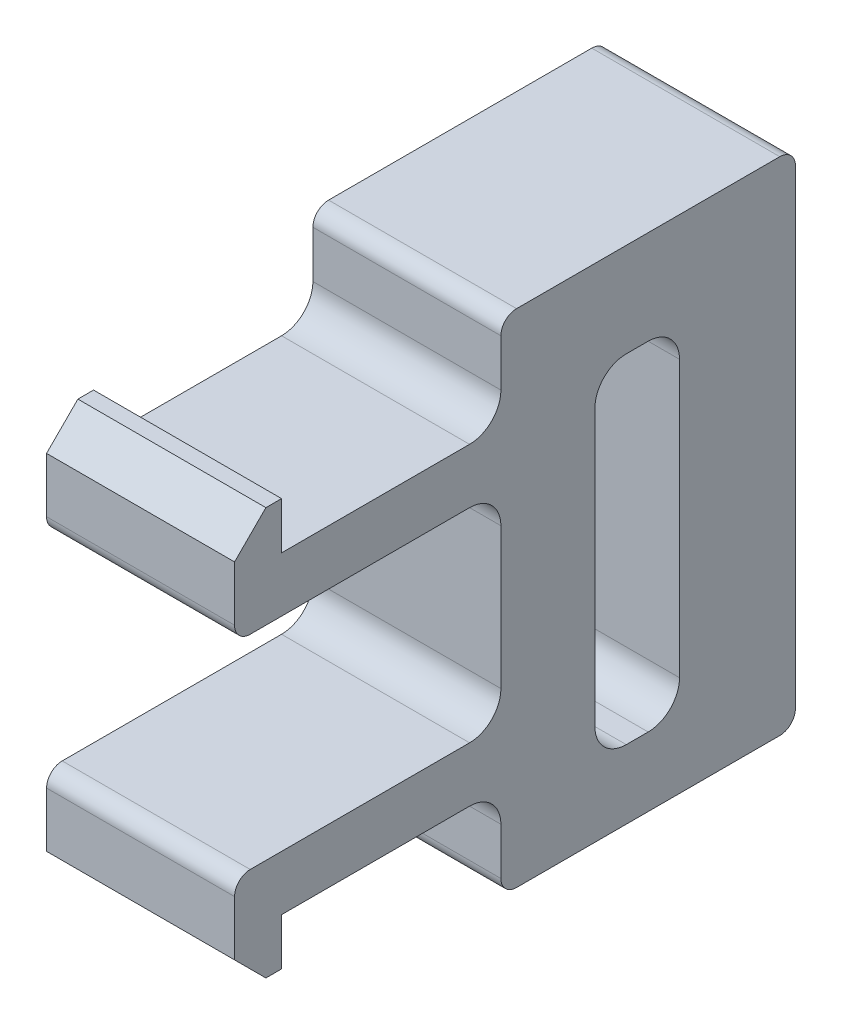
ISO-10303-21;
HEADER;
FILE_DESCRIPTION(('STEP AP214'),'2;1');
FILE_NAME('part.step','',(''),(''),'','','');
FILE_SCHEMA(('AUTOMOTIVE_DESIGN { 1 0 10303 214 1 1 1 1 }'));
ENDSEC;
DATA;
#1=APPLICATION_CONTEXT('core data for automotive mechanical design processes');
#2=APPLICATION_PROTOCOL_DEFINITION('international standard','automotive_design',2000,#1);
#3=PRODUCT_CONTEXT('',#1,'mechanical');
#4=PRODUCT('Part','Part','',(#3));
#5=PRODUCT_RELATED_PRODUCT_CATEGORY('part','',(#4));
#6=PRODUCT_DEFINITION_FORMATION('','',#4);
#7=PRODUCT_DEFINITION_CONTEXT('part definition',#1,'design');
#8=PRODUCT_DEFINITION('design','',#6,#7);
#9=PRODUCT_DEFINITION_SHAPE('','',#8);
#10=(LENGTH_UNIT() NAMED_UNIT(*) SI_UNIT(.MILLI.,.METRE.));
#11=(NAMED_UNIT(*) PLANE_ANGLE_UNIT() SI_UNIT($,.RADIAN.));
#12=(NAMED_UNIT(*) SI_UNIT($,.STERADIAN.) SOLID_ANGLE_UNIT());
#13=UNCERTAINTY_MEASURE_WITH_UNIT(LENGTH_MEASURE(1.E-05),#10,'distance_accuracy_value','');
#14=(GEOMETRIC_REPRESENTATION_CONTEXT(3) GLOBAL_UNCERTAINTY_ASSIGNED_CONTEXT((#13)) GLOBAL_UNIT_ASSIGNED_CONTEXT((#10,
#11,#12)) REPRESENTATION_CONTEXT('',''));
#15=CARTESIAN_POINT('',(0.,0.,0.));
#16=DIRECTION('',(0.,0.,1.));
#17=DIRECTION('',(1.,0.,0.));
#18=AXIS2_PLACEMENT_3D('',#15,#16,#17);
#19=CARTESIAN_POINT('',(52.8,29.5897807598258,9.4));
#20=DIRECTION('',(0.,0.,1.));
#21=DIRECTION('',(1.,0.,0.));
#22=AXIS2_PLACEMENT_3D('',#19,#20,#21);
#23=PLANE('',#22);
#24=DIRECTION('',(0.,-1.,0.));
#25=VECTOR('',#24,1.);
#26=CARTESIAN_POINT('',(52.8,45.5897807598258,9.4));
#27=LINE('',#26,#25);
#28=CARTESIAN_POINT('',(52.8,39.8397807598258,9.4));
#29=VERTEX_POINT('',#28);
#30=CARTESIAN_POINT('',(52.8,35.3397807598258,9.4));
#31=VERTEX_POINT('',#30);
#32=EDGE_CURVE('E461',#29,#31,#27,.T.);
#33=ORIENTED_EDGE('',*,*,#32,.T.);
#34=DIRECTION('',(-1.,0.,0.));
#35=VECTOR('',#34,1.);
#36=CARTESIAN_POINT('',(58.8,35.3397807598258,9.4));
#37=LINE('',#36,#35);
#38=CARTESIAN_POINT('',(58.8,35.3397807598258,9.4));
#39=VERTEX_POINT('',#38);
#40=EDGE_CURVE('E504',#31,#39,#37,.F.);
#41=ORIENTED_EDGE('',*,*,#40,.T.);
#42=DIRECTION('',(0.,1.,0.));
#43=VECTOR('',#42,1.);
#44=CARTESIAN_POINT('',(58.8,45.5897807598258,9.4));
#45=LINE('',#44,#43);
#46=CARTESIAN_POINT('',(58.8,39.8397807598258,9.4));
#47=VERTEX_POINT('',#46);
#48=EDGE_CURVE('E458',#39,#47,#45,.T.);
#49=ORIENTED_EDGE('',*,*,#48,.T.);
#50=DIRECTION('',(1.,0.,0.));
#51=VECTOR('',#50,1.);
#52=CARTESIAN_POINT('',(52.8,39.8397807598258,9.4));
#53=LINE('',#52,#51);
#54=EDGE_CURVE('E502',#47,#29,#53,.F.);
#55=ORIENTED_EDGE('',*,*,#54,.T.);
#56=EDGE_LOOP('',(#33,#41,#49,#55));
#57=FACE_BOUND('',#56,.T.);
#58=ADVANCED_FACE('F67',(#57),#23,.T.);
#59=CARTESIAN_POINT('',(52.8,31.5897807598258,9.4));
#60=VERTEX_POINT('',#59);
#61=CARTESIAN_POINT('',(52.8,30.0897807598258,9.4));
#62=VERTEX_POINT('',#61);
#63=EDGE_CURVE('E457',#60,#62,#27,.T.);
#64=ORIENTED_EDGE('',*,*,#63,.T.);
#65=DIRECTION('',(1.,0.,0.));
#66=VECTOR('',#65,1.);
#67=CARTESIAN_POINT('',(58.8,30.0897807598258,9.4));
#68=LINE('',#67,#66);
#69=CARTESIAN_POINT('',(58.8,30.0897807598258,9.4));
#70=VERTEX_POINT('',#69);
#71=EDGE_CURVE('E601',#62,#70,#68,.T.);
#72=ORIENTED_EDGE('',*,*,#71,.T.);
#73=CARTESIAN_POINT('',(58.8,31.5897807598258,9.4));
#74=VERTEX_POINT('',#73);
#75=EDGE_CURVE('E455',#70,#74,#45,.T.);
#76=ORIENTED_EDGE('',*,*,#75,.T.);
#77=DIRECTION('',(1.,0.,0.));
#78=VECTOR('',#77,1.);
#79=CARTESIAN_POINT('',(52.8,31.5897807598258,9.4));
#80=LINE('',#79,#78);
#81=EDGE_CURVE('E514',#74,#60,#80,.F.);
#82=ORIENTED_EDGE('',*,*,#81,.T.);
#83=EDGE_LOOP('',(#64,#72,#76,#82));
#84=FACE_BOUND('',#83,.T.);
#85=ADVANCED_FACE('F619',(#84),#23,.T.);
#86=CARTESIAN_POINT('',(58.8,45.5897807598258,3.7));
#87=DIRECTION('',(0.,0.,-1.));
#88=DIRECTION('',(-1.,0.,0.));
#89=AXIS2_PLACEMENT_3D('',#86,#87,#88);
#90=PLANE('',#89);
#91=DIRECTION('',(1.,0.,0.));
#92=VECTOR('',#91,1.);
#93=CARTESIAN_POINT('',(52.8,41.5897807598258,3.7));
#94=LINE('',#93,#92);
#95=CARTESIAN_POINT('',(58.8,41.5897807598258,3.7));
#96=VERTEX_POINT('',#95);
#97=CARTESIAN_POINT('',(53.5846096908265,41.5897807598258,3.7));
#98=VERTEX_POINT('',#97);
#99=EDGE_CURVE('E491',#96,#98,#94,.F.);
#100=ORIENTED_EDGE('',*,*,#99,.T.);
#101=DIRECTION('',(0.258819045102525,-0.965925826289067,0.));
#102=VECTOR('',#101,1.);
#103=CARTESIAN_POINT('',(52.9339745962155,44.0179839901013,3.7));
#104=LINE('',#103,#102);
#105=CARTESIAN_POINT('',(53.8525588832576,40.5897807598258,3.7));
#106=VERTEX_POINT('',#105);
#107=EDGE_CURVE('E82',#98,#106,#104,.T.);
#108=ORIENTED_EDGE('',*,*,#107,.T.);
#109=DIRECTION('',(-1.,0.,0.));
#110=VECTOR('',#109,1.);
#111=CARTESIAN_POINT('',(52.8,40.5897807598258,3.7));
#112=LINE('',#111,#110);
#113=CARTESIAN_POINT('',(54.8,40.5897807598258,3.7));
#114=VERTEX_POINT('',#113);
#115=EDGE_CURVE('E465',#114,#106,#112,.T.);
#116=ORIENTED_EDGE('',*,*,#115,.F.);
#117=CARTESIAN_POINT('',(54.8,39.5897807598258,3.7));
#118=DIRECTION('',(0.,0.,-1.));
#119=DIRECTION('',(-1.,0.,0.));
#120=AXIS2_PLACEMENT_3D('',#117,#118,#119);
#121=CIRCLE('',#120,1.);
#122=CARTESIAN_POINT('',(55.8,39.5897807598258,3.7));
#123=VERTEX_POINT('',#122);
#124=EDGE_CURVE('E550',#114,#123,#121,.T.);
#125=ORIENTED_EDGE('',*,*,#124,.T.);
#126=DIRECTION('',(0.,1.,0.));
#127=VECTOR('',#126,1.);
#128=CARTESIAN_POINT('',(55.8,29.5897807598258,3.7));
#129=LINE('',#128,#127);
#130=CARTESIAN_POINT('',(55.8,33.3218315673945,3.7));
#131=VERTEX_POINT('',#130);
#132=EDGE_CURVE('E463',#131,#123,#129,.T.);
#133=ORIENTED_EDGE('',*,*,#132,.F.);
#134=CARTESIAN_POINT('',(55.9425625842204,32.7897807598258,3.7));
#135=VERTEX_POINT('',#134);
#136=EDGE_CURVE('E371',#131,#135,#104,.T.);
#137=ORIENTED_EDGE('',*,*,#136,.T.);
#138=DIRECTION('',(-1.,0.,0.));
#139=VECTOR('',#138,1.);
#140=CARTESIAN_POINT('',(58.8,32.7897807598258,3.7));
#141=LINE('',#140,#139);
#142=CARTESIAN_POINT('',(58.8,32.7897807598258,3.7));
#143=VERTEX_POINT('',#142);
#144=EDGE_CURVE('E489',#135,#143,#141,.F.);
#145=ORIENTED_EDGE('',*,*,#144,.T.);
#146=DIRECTION('',(0.,1.,0.));
#147=VECTOR('',#146,1.);
#148=CARTESIAN_POINT('',(58.8,29.5897807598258,3.7));
#149=LINE('',#148,#147);
#150=EDGE_CURVE('E478',#143,#96,#149,.T.);
#151=ORIENTED_EDGE('',*,*,#150,.T.);
#152=EDGE_LOOP('',(#100,#108,#116,#125,#133,#137,#145,#151));
#153=FACE_BOUND('',#152,.T.);
#154=ADVANCED_FACE('F724',(#153),#90,.F.);
#155=CARTESIAN_POINT('',(58.8,45.5897807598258,3.7));
#156=DIRECTION('',(0.,-1.,0.));
#157=DIRECTION('',(0.,0.,-1.));
#158=AXIS2_PLACEMENT_3D('',#155,#156,#157);
#159=PLANE('',#158);
#160=DIRECTION('',(0.,0.,-1.));
#161=VECTOR('',#160,1.);
#162=CARTESIAN_POINT('',(52.8,45.5897807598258,3.7));
#163=LINE('',#162,#161);
#164=CARTESIAN_POINT('',(52.8,45.5897807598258,8.9));
#165=VERTEX_POINT('',#164);
#166=CARTESIAN_POINT('',(52.8,45.5897807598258,0.5));
#167=VERTEX_POINT('',#166);
#168=EDGE_CURVE('E687',#165,#167,#163,.T.);
#169=ORIENTED_EDGE('',*,*,#168,.F.);
#170=DIRECTION('',(-1.,0.,0.));
#171=VECTOR('',#170,1.);
#172=CARTESIAN_POINT('',(58.8,45.5897807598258,8.9));
#173=LINE('',#172,#171);
#174=CARTESIAN_POINT('',(58.8,45.5897807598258,8.9));
#175=VERTEX_POINT('',#174);
#176=EDGE_CURVE('E594',#165,#175,#173,.F.);
#177=ORIENTED_EDGE('',*,*,#176,.T.);
#178=DIRECTION('',(0.,0.,-1.));
#179=VECTOR('',#178,1.);
#180=CARTESIAN_POINT('',(58.8,45.5897807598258,3.7));
#181=LINE('',#180,#179);
#182=CARTESIAN_POINT('',(58.8,45.5897807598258,0.5));
#183=VERTEX_POINT('',#182);
#184=EDGE_CURVE('E481',#175,#183,#181,.T.);
#185=ORIENTED_EDGE('',*,*,#184,.T.);
#186=DIRECTION('',(-1.,0.,0.));
#187=VECTOR('',#186,1.);
#188=CARTESIAN_POINT('',(52.8,45.5897807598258,0.5));
#189=LINE('',#188,#187);
#190=EDGE_CURVE('E591',#183,#167,#189,.T.);
#191=ORIENTED_EDGE('',*,*,#190,.T.);
#192=EDGE_LOOP('',(#169,#177,#185,#191));
#193=FACE_BOUND('',#192,.T.);
#194=ADVANCED_FACE('F69',(#193),#159,.F.);
#195=CARTESIAN_POINT('',(52.8,45.5897807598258,3.7));
#196=DIRECTION('',(1.,0.,0.));
#197=DIRECTION('',(0.,1.,0.));
#198=AXIS2_PLACEMENT_3D('',#195,#196,#197);
#199=PLANE('',#198);
#200=DIRECTION('',(0.,0.,1.));
#201=VECTOR('',#200,1.);
#202=CARTESIAN_POINT('',(52.8,44.5179839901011,3.7));
#203=LINE('',#202,#201);
#204=CARTESIAN_POINT('',(52.8,44.5179839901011,0.));
#205=VERTEX_POINT('',#204);
#206=CARTESIAN_POINT('',(52.8,44.5179839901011,6.4));
#207=VERTEX_POINT('',#206);
#208=EDGE_CURVE('E388',#205,#207,#203,.T.);
#209=ORIENTED_EDGE('',*,*,#208,.T.);
#210=DIRECTION('',(0.,-1.,0.));
#211=VECTOR('',#210,1.);
#212=CARTESIAN_POINT('',(52.8,45.5897807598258,6.4));
#213=LINE('',#212,#211);
#214=CARTESIAN_POINT('',(52.8,29.5897807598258,6.4));
#215=VERTEX_POINT('',#214);
#216=EDGE_CURVE('E452',#207,#215,#213,.T.);
#217=ORIENTED_EDGE('',*,*,#216,.T.);
#218=DIRECTION('',(0.,0.,-1.));
#219=VECTOR('',#218,1.);
#220=CARTESIAN_POINT('',(52.8,29.5897807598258,9.4));
#221=LINE('',#220,#219);
#222=CARTESIAN_POINT('',(52.8,29.5897807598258,8.9));
#223=VERTEX_POINT('',#222);
#224=EDGE_CURVE('E342',#223,#215,#221,.T.);
#225=ORIENTED_EDGE('',*,*,#224,.F.);
#226=CARTESIAN_POINT('',(52.8,30.0897807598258,8.9));
#227=DIRECTION('',(1.,0.,0.));
#228=DIRECTION('',(0.,1.,0.));
#229=AXIS2_PLACEMENT_3D('',#226,#227,#228);
#230=CIRCLE('',#229,0.5);
#231=EDGE_CURVE('E559',#223,#62,#230,.F.);
#232=ORIENTED_EDGE('',*,*,#231,.T.);
#233=ORIENTED_EDGE('',*,*,#63,.F.);
#234=CARTESIAN_POINT('',(52.8,31.5897807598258,10.4));
#235=DIRECTION('',(1.,0.,0.));
#236=DIRECTION('',(0.,1.,0.));
#237=AXIS2_PLACEMENT_3D('',#234,#235,#236);
#238=CIRCLE('',#237,1.);
#239=CARTESIAN_POINT('',(52.8,32.5897807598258,10.4));
#240=VERTEX_POINT('',#239);
#241=EDGE_CURVE('E544',#60,#240,#238,.T.);
#242=ORIENTED_EDGE('',*,*,#241,.T.);
#243=DIRECTION('',(0.,0.,1.));
#244=VECTOR('',#243,1.);
#245=CARTESIAN_POINT('',(52.8,32.5897807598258,8.18321631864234));
#246=LINE('',#245,#244);
#247=CARTESIAN_POINT('',(52.8,32.5897807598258,16.4));
#248=VERTEX_POINT('',#247);
#249=EDGE_CURVE('E420',#240,#248,#246,.T.);
#250=ORIENTED_EDGE('',*,*,#249,.T.);
#251=DIRECTION('',(0.,-1.,0.));
#252=VECTOR('',#251,1.);
#253=CARTESIAN_POINT('',(52.8,32.5897807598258,16.4));
#254=LINE('',#253,#252);
#255=CARTESIAN_POINT('',(52.8,31.0897807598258,16.4));
#256=VERTEX_POINT('',#255);
#257=EDGE_CURVE('E422',#248,#256,#254,.T.);
#258=ORIENTED_EDGE('',*,*,#257,.T.);
#259=DIRECTION('',(0.,0.,1.));
#260=VECTOR('',#259,1.);
#261=CARTESIAN_POINT('',(52.8,31.0897807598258,16.4));
#262=LINE('',#261,#260);
#263=CARTESIAN_POINT('',(52.8,31.0897807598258,16.9));
#264=VERTEX_POINT('',#263);
#265=EDGE_CURVE('E425',#256,#264,#262,.T.);
#266=ORIENTED_EDGE('',*,*,#265,.T.);
#267=DIRECTION('',(0.,-0.70710678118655,-0.707106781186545));
#268=VECTOR('',#267,1.);
#269=CARTESIAN_POINT('',(52.8,31.0897807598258,16.9));
#270=LINE('',#269,#268);
#271=CARTESIAN_POINT('',(52.8,32.0897807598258,17.9));
#272=VERTEX_POINT('',#271);
#273=EDGE_CURVE('E662',#264,#272,#270,.F.);
#274=ORIENTED_EDGE('',*,*,#273,.T.);
#275=DIRECTION('',(0.,1.,0.));
#276=VECTOR('',#275,1.);
#277=CARTESIAN_POINT('',(52.8,34.3397807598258,17.9));
#278=LINE('',#277,#276);
#279=CARTESIAN_POINT('',(52.8,33.8397807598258,17.9));
#280=VERTEX_POINT('',#279);
#281=EDGE_CURVE('E428',#272,#280,#278,.T.);
#282=ORIENTED_EDGE('',*,*,#281,.T.);
#283=CARTESIAN_POINT('',(52.8,33.8397807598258,17.4));
#284=DIRECTION('',(1.,0.,0.));
#285=DIRECTION('',(0.,1.,0.));
#286=AXIS2_PLACEMENT_3D('',#283,#284,#285);
#287=CIRCLE('',#286,0.5);
#288=CARTESIAN_POINT('',(52.8,34.3397807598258,17.4));
#289=VERTEX_POINT('',#288);
#290=EDGE_CURVE('E567',#280,#289,#287,.F.);
#291=ORIENTED_EDGE('',*,*,#290,.T.);
#292=DIRECTION('',(0.,0.,-1.));
#293=VECTOR('',#292,1.);
#294=CARTESIAN_POINT('',(52.8,34.3397807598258,17.9));
#295=LINE('',#294,#293);
#296=CARTESIAN_POINT('',(52.8,34.3397807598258,10.4));
#297=VERTEX_POINT('',#296);
#298=EDGE_CURVE('E431',#289,#297,#295,.T.);
#299=ORIENTED_EDGE('',*,*,#298,.T.);
#300=CARTESIAN_POINT('',(52.8,35.3397807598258,10.4));
#301=DIRECTION('',(1.,0.,0.));
#302=DIRECTION('',(0.,1.,0.));
#303=AXIS2_PLACEMENT_3D('',#300,#301,#302);
#304=CIRCLE('',#303,1.);
#305=EDGE_CURVE('E532',#297,#31,#304,.T.);
#306=ORIENTED_EDGE('',*,*,#305,.T.);
#307=ORIENTED_EDGE('',*,*,#32,.F.);
#308=CARTESIAN_POINT('',(52.8,39.8397807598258,10.4));
#309=DIRECTION('',(1.,0.,0.));
#310=DIRECTION('',(0.,1.,0.));
#311=AXIS2_PLACEMENT_3D('',#308,#309,#310);
#312=CIRCLE('',#311,1.);
#313=CARTESIAN_POINT('',(52.8,40.8397807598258,10.4));
#314=VERTEX_POINT('',#313);
#315=EDGE_CURVE('E548',#29,#314,#312,.T.);
#316=ORIENTED_EDGE('',*,*,#315,.T.);
#317=DIRECTION('',(0.,0.,1.));
#318=VECTOR('',#317,1.);
#319=CARTESIAN_POINT('',(52.8,40.8397807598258,17.9));
#320=LINE('',#319,#318);
#321=CARTESIAN_POINT('',(52.8,40.8397807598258,17.4));
#322=VERTEX_POINT('',#321);
#323=EDGE_CURVE('E433',#314,#322,#320,.T.);
#324=ORIENTED_EDGE('',*,*,#323,.T.);
#325=CARTESIAN_POINT('',(52.8,41.3397807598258,17.4));
#326=DIRECTION('',(1.,0.,0.));
#327=DIRECTION('',(0.,1.,0.));
#328=AXIS2_PLACEMENT_3D('',#325,#326,#327);
#329=CIRCLE('',#328,0.5);
#330=CARTESIAN_POINT('',(52.8,41.3397807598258,17.9));
#331=VERTEX_POINT('',#330);
#332=EDGE_CURVE('E565',#322,#331,#329,.F.);
#333=ORIENTED_EDGE('',*,*,#332,.T.);
#334=DIRECTION('',(0.,1.,0.));
#335=VECTOR('',#334,1.);
#336=CARTESIAN_POINT('',(52.8,44.0897807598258,17.9));
#337=LINE('',#336,#335);
#338=CARTESIAN_POINT('',(52.8,43.0897807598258,17.9));
#339=VERTEX_POINT('',#338);
#340=EDGE_CURVE('E436',#331,#339,#337,.T.);
#341=ORIENTED_EDGE('',*,*,#340,.T.);
#342=DIRECTION('',(0.,-0.707106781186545,0.70710678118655));
#343=VECTOR('',#342,1.);
#344=CARTESIAN_POINT('',(52.8,43.0897807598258,17.9));
#345=LINE('',#344,#343);
#346=CARTESIAN_POINT('',(52.8,44.0897807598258,16.9));
#347=VERTEX_POINT('',#346);
#348=EDGE_CURVE('E694',#339,#347,#345,.F.);
#349=ORIENTED_EDGE('',*,*,#348,.T.);
#350=DIRECTION('',(0.,0.,-1.));
#351=VECTOR('',#350,1.);
#352=CARTESIAN_POINT('',(52.8,44.0897807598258,16.4));
#353=LINE('',#352,#351);
#354=CARTESIAN_POINT('',(52.8,44.0897807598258,16.4));
#355=VERTEX_POINT('',#354);
#356=EDGE_CURVE('E438',#347,#355,#353,.T.);
#357=ORIENTED_EDGE('',*,*,#356,.T.);
#358=DIRECTION('',(0.,-1.,0.));
#359=VECTOR('',#358,1.);
#360=CARTESIAN_POINT('',(52.8,42.5897807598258,16.4));
#361=LINE('',#360,#359);
#362=CARTESIAN_POINT('',(52.8,42.5897807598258,16.4));
#363=VERTEX_POINT('',#362);
#364=EDGE_CURVE('E391',#355,#363,#361,.T.);
#365=ORIENTED_EDGE('',*,*,#364,.T.);
#366=DIRECTION('',(0.,0.,-1.));
#367=VECTOR('',#366,1.);
#368=CARTESIAN_POINT('',(52.8,42.5897807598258,8.18321631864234));
#369=LINE('',#368,#367);
#370=CARTESIAN_POINT('',(52.8,42.5897807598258,10.4));
#371=VERTEX_POINT('',#370);
#372=EDGE_CURVE('E417',#363,#371,#369,.T.);
#373=ORIENTED_EDGE('',*,*,#372,.T.);
#374=CARTESIAN_POINT('',(52.8,43.5897807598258,10.4));
#375=DIRECTION('',(1.,0.,0.));
#376=DIRECTION('',(0.,1.,0.));
#377=AXIS2_PLACEMENT_3D('',#374,#375,#376);
#378=CIRCLE('',#377,1.);
#379=CARTESIAN_POINT('',(52.8,43.5897807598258,9.4));
#380=VERTEX_POINT('',#379);
#381=EDGE_CURVE('E536',#371,#380,#378,.T.);
#382=ORIENTED_EDGE('',*,*,#381,.T.);
#383=CARTESIAN_POINT('',(52.8,45.0897807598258,9.4));
#384=VERTEX_POINT('',#383);
#385=EDGE_CURVE('E459',#384,#380,#27,.T.);
#386=ORIENTED_EDGE('',*,*,#385,.F.);
#387=CARTESIAN_POINT('',(52.8,45.0897807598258,8.9));
#388=DIRECTION('',(1.,0.,0.));
#389=DIRECTION('',(0.,1.,0.));
#390=AXIS2_PLACEMENT_3D('',#387,#388,#389);
#391=CIRCLE('',#390,0.5);
#392=EDGE_CURVE('E563',#384,#165,#391,.F.);
#393=ORIENTED_EDGE('',*,*,#392,.T.);
#394=ORIENTED_EDGE('',*,*,#168,.T.);
#395=CARTESIAN_POINT('',(52.8,45.0897807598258,0.5));
#396=DIRECTION('',(1.,0.,0.));
#397=DIRECTION('',(0.,1.,0.));
#398=AXIS2_PLACEMENT_3D('',#395,#396,#397);
#399=CIRCLE('',#398,0.5);
#400=CARTESIAN_POINT('',(52.8,45.0897807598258,0.));
#401=VERTEX_POINT('',#400);
#402=EDGE_CURVE('E561',#167,#401,#399,.F.);
#403=ORIENTED_EDGE('',*,*,#402,.T.);
#404=DIRECTION('',(0.,-1.,0.));
#405=VECTOR('',#404,1.);
#406=CARTESIAN_POINT('',(52.8,45.5897807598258,0.));
#407=LINE('',#406,#405);
#408=EDGE_CURVE('E472',#401,#205,#407,.T.);
#409=ORIENTED_EDGE('',*,*,#408,.T.);
#410=EDGE_LOOP('',(#209,#217,#225,#232,#233,#242,#250,#258,#266,#274,#282,#291,#299,#306,#307,
#316,#324,#333,#341,#349,#357,#365,#373,#382,#386,#393,#394,#403,#409));
#411=FACE_BOUND('',#410,.T.);
#412=ADVANCED_FACE('F612',(#411),#199,.F.);
#413=CARTESIAN_POINT('',(52.8,29.5897807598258,3.7));
#414=DIRECTION('',(0.,1.,0.));
#415=DIRECTION('',(0.,0.,1.));
#416=AXIS2_PLACEMENT_3D('',#413,#414,#415);
#417=PLANE('',#416);
#418=DIRECTION('',(1.,0.,0.));
#419=VECTOR('',#418,1.);
#420=CARTESIAN_POINT('',(58.8,29.5897807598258,6.4));
#421=LINE('',#420,#419);
#422=CARTESIAN_POINT('',(56.8,29.5897807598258,6.4));
#423=VERTEX_POINT('',#422);
#424=EDGE_CURVE('E335',#215,#423,#421,.T.);
#425=ORIENTED_EDGE('',*,*,#424,.T.);
#426=DIRECTION('',(0.,0.,-1.));
#427=VECTOR('',#426,1.);
#428=CARTESIAN_POINT('',(56.8,29.5897807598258,23.4705148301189));
#429=LINE('',#428,#427);
#430=CARTESIAN_POINT('',(56.8,29.5897807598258,0.5));
#431=VERTEX_POINT('',#430);
#432=EDGE_CURVE('E339',#423,#431,#429,.T.);
#433=ORIENTED_EDGE('',*,*,#432,.T.);
#434=DIRECTION('',(1.,0.,0.));
#435=VECTOR('',#434,1.);
#436=CARTESIAN_POINT('',(58.8,29.5897807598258,0.5));
#437=LINE('',#436,#435);
#438=CARTESIAN_POINT('',(58.8,29.5897807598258,0.5));
#439=VERTEX_POINT('',#438);
#440=EDGE_CURVE('E604',#431,#439,#437,.T.);
#441=ORIENTED_EDGE('',*,*,#440,.T.);
#442=DIRECTION('',(0.,0.,-1.));
#443=VECTOR('',#442,1.);
#444=CARTESIAN_POINT('',(58.8,29.5897807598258,3.7));
#445=LINE('',#444,#443);
#446=CARTESIAN_POINT('',(58.8,29.5897807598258,8.9));
#447=VERTEX_POINT('',#446);
#448=EDGE_CURVE('E608',#447,#439,#445,.T.);
#449=ORIENTED_EDGE('',*,*,#448,.F.);
#450=DIRECTION('',(1.,0.,0.));
#451=VECTOR('',#450,1.);
#452=CARTESIAN_POINT('',(52.8,29.5897807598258,8.9));
#453=LINE('',#452,#451);
#454=EDGE_CURVE('E75',#447,#223,#453,.F.);
#455=ORIENTED_EDGE('',*,*,#454,.T.);
#456=ORIENTED_EDGE('',*,*,#224,.T.);
#457=EDGE_LOOP('',(#425,#433,#441,#449,#455,#456));
#458=FACE_BOUND('',#457,.T.);
#459=ADVANCED_FACE('F337',(#458),#417,.F.);
#460=CARTESIAN_POINT('',(58.8,29.5897807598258,3.7));
#461=DIRECTION('',(-1.,0.,0.));
#462=DIRECTION('',(0.,0.,1.));
#463=AXIS2_PLACEMENT_3D('',#460,#461,#462);
#464=PLANE('',#463);
#465=DIRECTION('',(0.,0.,1.));
#466=VECTOR('',#465,1.);
#467=CARTESIAN_POINT('',(58.8,34.3397807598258,17.9));
#468=LINE('',#467,#466);
#469=CARTESIAN_POINT('',(58.8,34.3397807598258,10.4));
#470=VERTEX_POINT('',#469);
#471=CARTESIAN_POINT('',(58.8,34.3397807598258,17.4));
#472=VERTEX_POINT('',#471);
#473=EDGE_CURVE('E402',#470,#472,#468,.T.);
#474=ORIENTED_EDGE('',*,*,#473,.T.);
#475=CARTESIAN_POINT('',(58.8,33.8397807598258,17.4));
#476=DIRECTION('',(-1.,0.,0.));
#477=DIRECTION('',(0.,0.,1.));
#478=AXIS2_PLACEMENT_3D('',#475,#476,#477);
#479=CIRCLE('',#478,0.5);
#480=CARTESIAN_POINT('',(58.8,33.8397807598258,17.9));
#481=VERTEX_POINT('',#480);
#482=EDGE_CURVE('E581',#472,#481,#479,.F.);
#483=ORIENTED_EDGE('',*,*,#482,.T.);
#484=DIRECTION('',(0.,-1.,0.));
#485=VECTOR('',#484,1.);
#486=CARTESIAN_POINT('',(58.8,34.3397807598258,17.9));
#487=LINE('',#486,#485);
#488=CARTESIAN_POINT('',(58.8,32.0897807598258,17.9));
#489=VERTEX_POINT('',#488);
#490=EDGE_CURVE('E400',#481,#489,#487,.T.);
#491=ORIENTED_EDGE('',*,*,#490,.T.);
#492=DIRECTION('',(0.,0.70710678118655,0.707106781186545));
#493=VECTOR('',#492,1.);
#494=CARTESIAN_POINT('',(58.8,31.0897807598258,16.9));
#495=LINE('',#494,#493);
#496=CARTESIAN_POINT('',(58.8,31.0897807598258,16.9));
#497=VERTEX_POINT('',#496);
#498=EDGE_CURVE('E665',#489,#497,#495,.F.);
#499=ORIENTED_EDGE('',*,*,#498,.T.);
#500=DIRECTION('',(0.,0.,-1.));
#501=VECTOR('',#500,1.);
#502=CARTESIAN_POINT('',(58.8,31.0897807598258,16.4));
#503=LINE('',#502,#501);
#504=CARTESIAN_POINT('',(58.8,31.0897807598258,16.4));
#505=VERTEX_POINT('',#504);
#506=EDGE_CURVE('E398',#497,#505,#503,.T.);
#507=ORIENTED_EDGE('',*,*,#506,.T.);
#508=DIRECTION('',(0.,1.,0.));
#509=VECTOR('',#508,1.);
#510=CARTESIAN_POINT('',(58.8,32.5897807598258,16.4));
#511=LINE('',#510,#509);
#512=CARTESIAN_POINT('',(58.8,32.5897807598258,16.4));
#513=VERTEX_POINT('',#512);
#514=EDGE_CURVE('E395',#505,#513,#511,.T.);
#515=ORIENTED_EDGE('',*,*,#514,.T.);
#516=DIRECTION('',(0.,0.,-1.));
#517=VECTOR('',#516,1.);
#518=CARTESIAN_POINT('',(58.8,32.5897807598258,8.18321631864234));
#519=LINE('',#518,#517);
#520=CARTESIAN_POINT('',(58.8,32.5897807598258,10.4));
#521=VERTEX_POINT('',#520);
#522=EDGE_CURVE('E392',#513,#521,#519,.T.);
#523=ORIENTED_EDGE('',*,*,#522,.T.);
#524=CARTESIAN_POINT('',(58.8,31.5897807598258,10.4));
#525=DIRECTION('',(-1.,0.,0.));
#526=DIRECTION('',(0.,0.,1.));
#527=AXIS2_PLACEMENT_3D('',#524,#525,#526);
#528=CIRCLE('',#527,1.);
#529=EDGE_CURVE('E541',#521,#74,#528,.T.);
#530=ORIENTED_EDGE('',*,*,#529,.T.);
#531=ORIENTED_EDGE('',*,*,#75,.F.);
#532=CARTESIAN_POINT('',(58.8,30.0897807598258,8.9));
#533=DIRECTION('',(-1.,0.,0.));
#534=DIRECTION('',(0.,0.,1.));
#535=AXIS2_PLACEMENT_3D('',#532,#533,#534);
#536=CIRCLE('',#535,0.5);
#537=EDGE_CURVE('E573',#70,#447,#536,.F.);
#538=ORIENTED_EDGE('',*,*,#537,.T.);
#539=ORIENTED_EDGE('',*,*,#448,.T.);
#540=CARTESIAN_POINT('',(58.8,30.0897807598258,0.5));
#541=DIRECTION('',(-1.,0.,0.));
#542=DIRECTION('',(0.,0.,1.));
#543=AXIS2_PLACEMENT_3D('',#540,#541,#542);
#544=CIRCLE('',#543,0.5);
#545=CARTESIAN_POINT('',(58.8,30.0897807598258,0.));
#546=VERTEX_POINT('',#545);
#547=EDGE_CURVE('E571',#439,#546,#544,.F.);
#548=ORIENTED_EDGE('',*,*,#547,.T.);
#549=DIRECTION('',(0.,1.,0.));
#550=VECTOR('',#549,1.);
#551=CARTESIAN_POINT('',(58.8,29.5897807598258,0.));
#552=LINE('',#551,#550);
#553=CARTESIAN_POINT('',(58.8,45.0897807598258,0.));
#554=VERTEX_POINT('',#553);
#555=EDGE_CURVE('E475',#546,#554,#552,.T.);
#556=ORIENTED_EDGE('',*,*,#555,.T.);
#557=CARTESIAN_POINT('',(58.8,45.0897807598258,0.5));
#558=DIRECTION('',(-1.,0.,0.));
#559=DIRECTION('',(0.,0.,1.));
#560=AXIS2_PLACEMENT_3D('',#557,#558,#559);
#561=CIRCLE('',#560,0.5);
#562=EDGE_CURVE('E575',#554,#183,#561,.F.);
#563=ORIENTED_EDGE('',*,*,#562,.T.);
#564=ORIENTED_EDGE('',*,*,#184,.F.);
#565=CARTESIAN_POINT('',(58.8,45.0897807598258,8.9));
#566=DIRECTION('',(-1.,0.,0.));
#567=DIRECTION('',(0.,0.,1.));
#568=AXIS2_PLACEMENT_3D('',#565,#566,#567);
#569=CIRCLE('',#568,0.5);
#570=CARTESIAN_POINT('',(58.8,45.0897807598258,9.4));
#571=VERTEX_POINT('',#570);
#572=EDGE_CURVE('E577',#175,#571,#569,.F.);
#573=ORIENTED_EDGE('',*,*,#572,.T.);
#574=CARTESIAN_POINT('',(58.8,43.5897807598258,9.4));
#575=VERTEX_POINT('',#574);
#576=EDGE_CURVE('E454',#575,#571,#45,.T.);
#577=ORIENTED_EDGE('',*,*,#576,.F.);
#578=CARTESIAN_POINT('',(58.8,43.5897807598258,10.4));
#579=DIRECTION('',(-1.,0.,0.));
#580=DIRECTION('',(0.,0.,1.));
#581=AXIS2_PLACEMENT_3D('',#578,#579,#580);
#582=CIRCLE('',#581,1.);
#583=CARTESIAN_POINT('',(58.8,42.5897807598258,10.4));
#584=VERTEX_POINT('',#583);
#585=EDGE_CURVE('E539',#575,#584,#582,.T.);
#586=ORIENTED_EDGE('',*,*,#585,.T.);
#587=DIRECTION('',(0.,0.,1.));
#588=VECTOR('',#587,1.);
#589=CARTESIAN_POINT('',(58.8,42.5897807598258,8.18321631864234));
#590=LINE('',#589,#588);
#591=CARTESIAN_POINT('',(58.8,42.5897807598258,16.4));
#592=VERTEX_POINT('',#591);
#593=EDGE_CURVE('E346',#584,#592,#590,.T.);
#594=ORIENTED_EDGE('',*,*,#593,.T.);
#595=DIRECTION('',(0.,1.,0.));
#596=VECTOR('',#595,1.);
#597=CARTESIAN_POINT('',(58.8,42.5897807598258,16.4));
#598=LINE('',#597,#596);
#599=CARTESIAN_POINT('',(58.8,44.0897807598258,16.4));
#600=VERTEX_POINT('',#599);
#601=EDGE_CURVE('E413',#592,#600,#598,.T.);
#602=ORIENTED_EDGE('',*,*,#601,.T.);
#603=DIRECTION('',(0.,0.,1.));
#604=VECTOR('',#603,1.);
#605=CARTESIAN_POINT('',(58.8,44.0897807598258,16.4));
#606=LINE('',#605,#604);
#607=CARTESIAN_POINT('',(58.8,44.0897807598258,16.9));
#608=VERTEX_POINT('',#607);
#609=EDGE_CURVE('E410',#600,#608,#606,.T.);
#610=ORIENTED_EDGE('',*,*,#609,.T.);
#611=DIRECTION('',(0.,0.707106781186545,-0.70710678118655));
#612=VECTOR('',#611,1.);
#613=CARTESIAN_POINT('',(58.8,43.0897807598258,17.9));
#614=LINE('',#613,#612);
#615=CARTESIAN_POINT('',(58.8,43.0897807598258,17.9));
#616=VERTEX_POINT('',#615);
#617=EDGE_CURVE('E661',#608,#616,#614,.F.);
#618=ORIENTED_EDGE('',*,*,#617,.T.);
#619=DIRECTION('',(0.,-1.,0.));
#620=VECTOR('',#619,1.);
#621=CARTESIAN_POINT('',(58.8,44.0897807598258,17.9));
#622=LINE('',#621,#620);
#623=CARTESIAN_POINT('',(58.8,41.3397807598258,17.9));
#624=VERTEX_POINT('',#623);
#625=EDGE_CURVE('E407',#616,#624,#622,.T.);
#626=ORIENTED_EDGE('',*,*,#625,.T.);
#627=CARTESIAN_POINT('',(58.8,41.3397807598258,17.4));
#628=DIRECTION('',(-1.,0.,0.));
#629=DIRECTION('',(0.,0.,1.));
#630=AXIS2_PLACEMENT_3D('',#627,#628,#629);
#631=CIRCLE('',#630,0.5);
#632=CARTESIAN_POINT('',(58.8,40.8397807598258,17.4));
#633=VERTEX_POINT('',#632);
#634=EDGE_CURVE('E579',#624,#633,#631,.F.);
#635=ORIENTED_EDGE('',*,*,#634,.T.);
#636=DIRECTION('',(0.,0.,-1.));
#637=VECTOR('',#636,1.);
#638=CARTESIAN_POINT('',(58.8,40.8397807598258,17.9));
#639=LINE('',#638,#637);
#640=CARTESIAN_POINT('',(58.8,40.8397807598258,10.4));
#641=VERTEX_POINT('',#640);
#642=EDGE_CURVE('E405',#633,#641,#639,.T.);
#643=ORIENTED_EDGE('',*,*,#642,.T.);
#644=CARTESIAN_POINT('',(58.8,39.8397807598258,10.4));
#645=DIRECTION('',(-1.,0.,0.));
#646=DIRECTION('',(0.,0.,1.));
#647=AXIS2_PLACEMENT_3D('',#644,#645,#646);
#648=CIRCLE('',#647,1.);
#649=EDGE_CURVE('E546',#641,#47,#648,.T.);
#650=ORIENTED_EDGE('',*,*,#649,.T.);
#651=ORIENTED_EDGE('',*,*,#48,.F.);
#652=CARTESIAN_POINT('',(58.8,35.3397807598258,10.4));
#653=DIRECTION('',(-1.,0.,0.));
#654=DIRECTION('',(0.,0.,1.));
#655=AXIS2_PLACEMENT_3D('',#652,#653,#654);
#656=CIRCLE('',#655,1.);
#657=EDGE_CURVE('E534',#39,#470,#656,.T.);
#658=ORIENTED_EDGE('',*,*,#657,.T.);
#659=EDGE_LOOP('',(#474,#483,#491,#499,#507,#515,#523,#530,#531,#538,#539,#548,#556,#563,#564,
#573,#577,#586,#594,#602,#610,#618,#626,#635,#643,#650,#651,#658));
#660=FACE_BOUND('',#659,.T.);
#661=DIRECTION('',(0.,0.,-1.));
#662=VECTOR('',#661,1.);
#663=CARTESIAN_POINT('',(58.8,31.7897807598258,6.4));
#664=LINE('',#663,#662);
#665=CARTESIAN_POINT('',(58.8,31.7897807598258,5.4));
#666=VERTEX_POINT('',#665);
#667=CARTESIAN_POINT('',(58.8,31.7897807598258,4.7));
#668=VERTEX_POINT('',#667);
#669=EDGE_CURVE('E468',#666,#668,#664,.T.);
#670=ORIENTED_EDGE('',*,*,#669,.F.);
#671=CARTESIAN_POINT('',(58.8,32.7897807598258,5.4));
#672=DIRECTION('',(-1.,0.,0.));
#673=DIRECTION('',(0.,0.,1.));
#674=AXIS2_PLACEMENT_3D('',#671,#672,#673);
#675=CIRCLE('',#674,1.);
#676=CARTESIAN_POINT('',(58.8,32.7897807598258,6.4));
#677=VERTEX_POINT('',#676);
#678=EDGE_CURVE('E530',#666,#677,#675,.T.);
#679=ORIENTED_EDGE('',*,*,#678,.T.);
#680=DIRECTION('',(0.,1.,0.));
#681=VECTOR('',#680,1.);
#682=CARTESIAN_POINT('',(58.8,45.5897807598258,6.4));
#683=LINE('',#682,#681);
#684=CARTESIAN_POINT('',(58.8,41.5897807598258,6.4));
#685=VERTEX_POINT('',#684);
#686=EDGE_CURVE('E345',#677,#685,#683,.T.);
#687=ORIENTED_EDGE('',*,*,#686,.T.);
#688=CARTESIAN_POINT('',(58.8,41.5897807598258,5.4));
#689=DIRECTION('',(-1.,0.,0.));
#690=DIRECTION('',(0.,0.,1.));
#691=AXIS2_PLACEMENT_3D('',#688,#689,#690);
#692=CIRCLE('',#691,1.);
#693=CARTESIAN_POINT('',(58.8,42.5897807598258,5.4));
#694=VERTEX_POINT('',#693);
#695=EDGE_CURVE('E524',#685,#694,#692,.T.);
#696=ORIENTED_EDGE('',*,*,#695,.T.);
#697=DIRECTION('',(0.,0.,-1.));
#698=VECTOR('',#697,1.);
#699=CARTESIAN_POINT('',(58.8,42.5897807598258,6.4));
#700=LINE('',#699,#698);
#701=CARTESIAN_POINT('',(58.8,42.5897807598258,4.7));
#702=VERTEX_POINT('',#701);
#703=EDGE_CURVE('E471',#694,#702,#700,.T.);
#704=ORIENTED_EDGE('',*,*,#703,.T.);
#705=CARTESIAN_POINT('',(58.8,41.5897807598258,4.7));
#706=DIRECTION('',(-1.,0.,0.));
#707=DIRECTION('',(0.,0.,1.));
#708=AXIS2_PLACEMENT_3D('',#705,#706,#707);
#709=CIRCLE('',#708,1.);
#710=EDGE_CURVE('E526',#702,#96,#709,.T.);
#711=ORIENTED_EDGE('',*,*,#710,.T.);
#712=ORIENTED_EDGE('',*,*,#150,.F.);
#713=CARTESIAN_POINT('',(58.8,32.7897807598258,4.7));
#714=DIRECTION('',(-1.,0.,0.));
#715=DIRECTION('',(0.,0.,1.));
#716=AXIS2_PLACEMENT_3D('',#713,#714,#715);
#717=CIRCLE('',#716,1.);
#718=EDGE_CURVE('E528',#143,#668,#717,.T.);
#719=ORIENTED_EDGE('',*,*,#718,.T.);
#720=EDGE_LOOP('',(#670,#679,#687,#696,#704,#711,#712,#719));
#721=FACE_BOUND('',#720,.T.);
#722=ADVANCED_FACE('F621',(#660,#721),#464,.F.);
#723=CARTESIAN_POINT('',(58.8,45.5897807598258,0.));
#724=DIRECTION('',(0.,0.,-1.));
#725=DIRECTION('',(-1.,0.,0.));
#726=AXIS2_PLACEMENT_3D('',#723,#724,#725);
#727=PLANE('',#726);
#728=DIRECTION('',(0.258819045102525,-0.965925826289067,0.));
#729=VECTOR('',#728,1.);
#730=CARTESIAN_POINT('',(56.8,29.5897807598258,0.));
#731=LINE('',#730,#729);
#732=CARTESIAN_POINT('',(53.8525588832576,40.5897807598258,0.));
#733=VERTEX_POINT('',#732);
#734=EDGE_CURVE('E356',#205,#733,#731,.T.);
#735=ORIENTED_EDGE('',*,*,#734,.F.);
#736=ORIENTED_EDGE('',*,*,#408,.F.);
#737=DIRECTION('',(-1.,0.,0.));
#738=VECTOR('',#737,1.);
#739=CARTESIAN_POINT('',(58.8,45.0897807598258,0.));
#740=LINE('',#739,#738);
#741=EDGE_CURVE('E599',#401,#554,#740,.F.);
#742=ORIENTED_EDGE('',*,*,#741,.T.);
#743=ORIENTED_EDGE('',*,*,#555,.F.);
#744=DIRECTION('',(1.,0.,0.));
#745=VECTOR('',#744,1.);
#746=CARTESIAN_POINT('',(55.8,30.0897807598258,0.));
#747=LINE('',#746,#745);
#748=CARTESIAN_POINT('',(56.6660254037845,30.0897807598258,0.));
#749=VERTEX_POINT('',#748);
#750=EDGE_CURVE('E596',#546,#749,#747,.F.);
#751=ORIENTED_EDGE('',*,*,#750,.T.);
#752=CARTESIAN_POINT('',(55.8,33.3218315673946,0.));
#753=VERTEX_POINT('',#752);
#754=EDGE_CURVE('E89',#753,#749,#731,.T.);
#755=ORIENTED_EDGE('',*,*,#754,.F.);
#756=DIRECTION('',(0.,-1.,0.));
#757=VECTOR('',#756,1.);
#758=CARTESIAN_POINT('',(55.8,45.5897807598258,0.));
#759=LINE('',#758,#757);
#760=CARTESIAN_POINT('',(55.8,39.5897807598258,0.));
#761=VERTEX_POINT('',#760);
#762=EDGE_CURVE('E688',#761,#753,#759,.T.);
#763=ORIENTED_EDGE('',*,*,#762,.F.);
#764=CARTESIAN_POINT('',(54.8,39.5897807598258,0.));
#765=DIRECTION('',(0.,0.,-1.));
#766=DIRECTION('',(-1.,0.,0.));
#767=AXIS2_PLACEMENT_3D('',#764,#765,#766);
#768=CIRCLE('',#767,1.);
#769=CARTESIAN_POINT('',(54.8,40.5897807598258,0.));
#770=VERTEX_POINT('',#769);
#771=EDGE_CURVE('E553',#761,#770,#768,.F.);
#772=ORIENTED_EDGE('',*,*,#771,.T.);
#773=DIRECTION('',(1.,0.,0.));
#774=VECTOR('',#773,1.);
#775=CARTESIAN_POINT('',(58.8,40.5897807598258,0.));
#776=LINE('',#775,#774);
#777=EDGE_CURVE('E691',#733,#770,#776,.T.);
#778=ORIENTED_EDGE('',*,*,#777,.F.);
#779=EDGE_LOOP('',(#735,#736,#742,#743,#751,#755,#763,#772,#778));
#780=FACE_BOUND('',#779,.T.);
#781=ADVANCED_FACE('F757',(#780),#727,.T.);
#782=CARTESIAN_POINT('',(52.8,42.5897807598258,6.4));
#783=DIRECTION('',(0.,1.,0.));
#784=DIRECTION('',(0.,0.,1.));
#785=AXIS2_PLACEMENT_3D('',#782,#783,#784);
#786=PLANE('',#785);
#787=DIRECTION('',(1.,0.,0.));
#788=VECTOR('',#787,1.);
#789=CARTESIAN_POINT('',(52.8,42.5897807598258,5.4));
#790=LINE('',#789,#788);
#791=CARTESIAN_POINT('',(53.3166604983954,42.5897807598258,5.4));
#792=VERTEX_POINT('',#791);
#793=EDGE_CURVE('E487',#694,#792,#790,.F.);
#794=ORIENTED_EDGE('',*,*,#793,.T.);
#795=DIRECTION('',(0.,0.,-1.));
#796=VECTOR('',#795,1.);
#797=CARTESIAN_POINT('',(53.3166604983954,42.5897807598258,6.4));
#798=LINE('',#797,#796);
#799=CARTESIAN_POINT('',(53.3166604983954,42.5897807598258,4.7));
#800=VERTEX_POINT('',#799);
#801=EDGE_CURVE('E379',#792,#800,#798,.T.);
#802=ORIENTED_EDGE('',*,*,#801,.T.);
#803=DIRECTION('',(1.,0.,0.));
#804=VECTOR('',#803,1.);
#805=CARTESIAN_POINT('',(58.8,42.5897807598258,4.7));
#806=LINE('',#805,#804);
#807=EDGE_CURVE('E681',#800,#702,#806,.T.);
#808=ORIENTED_EDGE('',*,*,#807,.T.);
#809=ORIENTED_EDGE('',*,*,#703,.F.);
#810=EDGE_LOOP('',(#794,#802,#808,#809));
#811=FACE_BOUND('',#810,.T.);
#812=ADVANCED_FACE('F776',(#811),#786,.F.);
#813=CARTESIAN_POINT('',(55.8,31.7897807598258,6.4));
#814=DIRECTION('',(0.,-1.,0.));
#815=DIRECTION('',(0.,0.,-1.));
#816=AXIS2_PLACEMENT_3D('',#813,#814,#815);
#817=PLANE('',#816);
#818=DIRECTION('',(-1.,0.,0.));
#819=VECTOR('',#818,1.);
#820=CARTESIAN_POINT('',(55.8,31.7897807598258,4.7));
#821=LINE('',#820,#819);
#822=CARTESIAN_POINT('',(56.2105117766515,31.7897807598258,4.7));
#823=VERTEX_POINT('',#822);
#824=EDGE_CURVE('E496',#668,#823,#821,.T.);
#825=ORIENTED_EDGE('',*,*,#824,.T.);
#826=DIRECTION('',(0.,0.,1.));
#827=VECTOR('',#826,1.);
#828=CARTESIAN_POINT('',(56.2105117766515,31.7897807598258,6.4));
#829=LINE('',#828,#827);
#830=CARTESIAN_POINT('',(56.2105117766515,31.7897807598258,5.4));
#831=VERTEX_POINT('',#830);
#832=EDGE_CURVE('E361',#823,#831,#829,.T.);
#833=ORIENTED_EDGE('',*,*,#832,.T.);
#834=DIRECTION('',(-1.,0.,0.));
#835=VECTOR('',#834,1.);
#836=CARTESIAN_POINT('',(58.8,31.7897807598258,5.4));
#837=LINE('',#836,#835);
#838=EDGE_CURVE('E494',#831,#666,#837,.F.);
#839=ORIENTED_EDGE('',*,*,#838,.T.);
#840=ORIENTED_EDGE('',*,*,#669,.T.);
#841=EDGE_LOOP('',(#825,#833,#839,#840));
#842=FACE_BOUND('',#841,.T.);
#843=ADVANCED_FACE('F788',(#842),#817,.F.);
#844=CARTESIAN_POINT('',(55.8,29.5897807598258,6.4));
#845=DIRECTION('',(1.,0.,0.));
#846=DIRECTION('',(0.,0.,-1.));
#847=AXIS2_PLACEMENT_3D('',#844,#845,#846);
#848=PLANE('',#847);
#849=ORIENTED_EDGE('',*,*,#762,.T.);
#850=DIRECTION('',(0.,0.,1.));
#851=VECTOR('',#850,1.);
#852=CARTESIAN_POINT('',(55.8,33.3218315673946,6.4));
#853=LINE('',#852,#851);
#854=EDGE_CURVE('E374',#753,#131,#853,.T.);
#855=ORIENTED_EDGE('',*,*,#854,.T.);
#856=ORIENTED_EDGE('',*,*,#132,.T.);
#857=DIRECTION('',(0.,0.,1.));
#858=VECTOR('',#857,1.);
#859=CARTESIAN_POINT('',(55.8,39.5897807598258,0.));
#860=LINE('',#859,#858);
#861=EDGE_CURVE('E522',#123,#761,#860,.F.);
#862=ORIENTED_EDGE('',*,*,#861,.T.);
#863=EDGE_LOOP('',(#849,#855,#856,#862));
#864=FACE_BOUND('',#863,.T.);
#865=ADVANCED_FACE('F796',(#864),#848,.F.);
#866=CARTESIAN_POINT('',(52.8,40.5897807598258,-1.3));
#867=DIRECTION('',(0.,1.,0.));
#868=DIRECTION('',(0.,0.,1.));
#869=AXIS2_PLACEMENT_3D('',#866,#867,#868);
#870=PLANE('',#869);
#871=ORIENTED_EDGE('',*,*,#115,.T.);
#872=DIRECTION('',(0.,0.,-1.));
#873=VECTOR('',#872,1.);
#874=CARTESIAN_POINT('',(53.8525588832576,40.5897807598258,-1.3));
#875=LINE('',#874,#873);
#876=EDGE_CURVE('E385',#106,#733,#875,.T.);
#877=ORIENTED_EDGE('',*,*,#876,.T.);
#878=ORIENTED_EDGE('',*,*,#777,.T.);
#879=DIRECTION('',(0.,0.,1.));
#880=VECTOR('',#879,1.);
#881=CARTESIAN_POINT('',(54.8,40.5897807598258,3.7));
#882=LINE('',#881,#880);
#883=EDGE_CURVE('E519',#770,#114,#882,.T.);
#884=ORIENTED_EDGE('',*,*,#883,.T.);
#885=EDGE_LOOP('',(#871,#877,#878,#884));
#886=FACE_BOUND('',#885,.T.);
#887=ADVANCED_FACE('F733',(#886),#870,.F.);
#888=CARTESIAN_POINT('',(52.8,29.5897807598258,6.4));
#889=DIRECTION('',(0.,0.,1.));
#890=DIRECTION('',(1.,0.,0.));
#891=AXIS2_PLACEMENT_3D('',#888,#889,#890);
#892=PLANE('',#891);
#893=DIRECTION('',(0.258819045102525,-0.965925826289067,0.));
#894=VECTOR('',#893,1.);
#895=CARTESIAN_POINT('',(56.8,29.5897807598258,6.4));
#896=LINE('',#895,#894);
#897=CARTESIAN_POINT('',(55.9425625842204,32.7897807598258,6.4));
#898=VERTEX_POINT('',#897);
#899=EDGE_CURVE('E349',#898,#423,#896,.T.);
#900=ORIENTED_EDGE('',*,*,#899,.T.);
#901=ORIENTED_EDGE('',*,*,#424,.F.);
#902=ORIENTED_EDGE('',*,*,#216,.F.);
#903=CARTESIAN_POINT('',(53.5846096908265,41.5897807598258,6.4));
#904=VERTEX_POINT('',#903);
#905=EDGE_CURVE('E355',#207,#904,#896,.T.);
#906=ORIENTED_EDGE('',*,*,#905,.T.);
#907=DIRECTION('',(1.,0.,0.));
#908=VECTOR('',#907,1.);
#909=CARTESIAN_POINT('',(58.8,41.5897807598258,6.4));
#910=LINE('',#909,#908);
#911=EDGE_CURVE('E679',#904,#685,#910,.T.);
#912=ORIENTED_EDGE('',*,*,#911,.T.);
#913=ORIENTED_EDGE('',*,*,#686,.F.);
#914=DIRECTION('',(-1.,0.,0.));
#915=VECTOR('',#914,1.);
#916=CARTESIAN_POINT('',(55.8,32.7897807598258,6.4));
#917=LINE('',#916,#915);
#918=EDGE_CURVE('E353',#677,#898,#917,.T.);
#919=ORIENTED_EDGE('',*,*,#918,.T.);
#920=EDGE_LOOP('',(#900,#901,#902,#906,#912,#913,#919));
#921=FACE_BOUND('',#920,.T.);
#922=ADVANCED_FACE('F350',(#921),#892,.F.);
#923=ORIENTED_EDGE('',*,*,#576,.T.);
#924=DIRECTION('',(-1.,0.,0.));
#925=VECTOR('',#924,1.);
#926=CARTESIAN_POINT('',(52.8,45.0897807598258,9.4));
#927=LINE('',#926,#925);
#928=EDGE_CURVE('E588',#571,#384,#927,.T.);
#929=ORIENTED_EDGE('',*,*,#928,.T.);
#930=ORIENTED_EDGE('',*,*,#385,.T.);
#931=DIRECTION('',(-1.,0.,0.));
#932=VECTOR('',#931,1.);
#933=CARTESIAN_POINT('',(58.8,43.5897807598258,9.4));
#934=LINE('',#933,#932);
#935=EDGE_CURVE('E509',#380,#575,#934,.F.);
#936=ORIENTED_EDGE('',*,*,#935,.T.);
#937=EDGE_LOOP('',(#923,#929,#930,#936));
#938=FACE_BOUND('',#937,.T.);
#939=ADVANCED_FACE('F720',(#938),#23,.T.);
#940=CARTESIAN_POINT('',(75.030091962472,32.5897807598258,16.4));
#941=DIRECTION('',(0.,0.,-1.));
#942=DIRECTION('',(0.,1.,0.));
#943=AXIS2_PLACEMENT_3D('',#940,#941,#942);
#944=PLANE('',#943);
#945=ORIENTED_EDGE('',*,*,#514,.F.);
#946=DIRECTION('',(-1.,0.,0.));
#947=VECTOR('',#946,1.);
#948=CARTESIAN_POINT('',(75.030091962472,31.0897807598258,16.4));
#949=LINE('',#948,#947);
#950=EDGE_CURVE('E443',#505,#256,#949,.T.);
#951=ORIENTED_EDGE('',*,*,#950,.T.);
#952=ORIENTED_EDGE('',*,*,#257,.F.);
#953=DIRECTION('',(-1.,0.,0.));
#954=VECTOR('',#953,1.);
#955=CARTESIAN_POINT('',(75.030091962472,32.5897807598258,16.4));
#956=LINE('',#955,#954);
#957=EDGE_CURVE('E445',#513,#248,#956,.T.);
#958=ORIENTED_EDGE('',*,*,#957,.F.);
#959=EDGE_LOOP('',(#945,#951,#952,#958));
#960=FACE_BOUND('',#959,.T.);
#961=ADVANCED_FACE('F703',(#960),#944,.T.);
#962=CARTESIAN_POINT('',(75.030091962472,31.0897807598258,16.4));
#963=DIRECTION('',(0.,-1.,0.));
#964=DIRECTION('',(0.,0.,-1.));
#965=AXIS2_PLACEMENT_3D('',#962,#963,#964);
#966=PLANE('',#965);
#967=ORIENTED_EDGE('',*,*,#506,.F.);
#968=DIRECTION('',(-1.,0.,0.));
#969=VECTOR('',#968,1.);
#970=CARTESIAN_POINT('',(75.030091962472,31.0897807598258,16.9));
#971=LINE('',#970,#969);
#972=EDGE_CURVE('E668',#497,#264,#971,.T.);
#973=ORIENTED_EDGE('',*,*,#972,.T.);
#974=ORIENTED_EDGE('',*,*,#265,.F.);
#975=ORIENTED_EDGE('',*,*,#950,.F.);
#976=EDGE_LOOP('',(#967,#973,#974,#975));
#977=FACE_BOUND('',#976,.T.);
#978=ADVANCED_FACE('F698',(#977),#966,.T.);
#979=CARTESIAN_POINT('',(75.030091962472,34.3397807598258,17.9));
#980=DIRECTION('',(0.,0.,1.));
#981=DIRECTION('',(0.,-1.,0.));
#982=AXIS2_PLACEMENT_3D('',#979,#980,#981);
#983=PLANE('',#982);
#984=ORIENTED_EDGE('',*,*,#490,.F.);
#985=DIRECTION('',(-1.,0.,0.));
#986=VECTOR('',#985,1.);
#987=CARTESIAN_POINT('',(75.030091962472,33.8397807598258,17.9));
#988=LINE('',#987,#986);
#989=EDGE_CURVE('E556',#481,#280,#988,.T.);
#990=ORIENTED_EDGE('',*,*,#989,.T.);
#991=ORIENTED_EDGE('',*,*,#281,.F.);
#992=DIRECTION('',(1.,0.,0.));
#993=VECTOR('',#992,1.);
#994=CARTESIAN_POINT('',(75.030091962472,32.0897807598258,17.9));
#995=LINE('',#994,#993);
#996=EDGE_CURVE('E658',#272,#489,#995,.T.);
#997=ORIENTED_EDGE('',*,*,#996,.T.);
#998=EDGE_LOOP('',(#984,#990,#991,#997));
#999=FACE_BOUND('',#998,.T.);
#1000=ADVANCED_FACE('F655',(#999),#983,.T.);
#1001=CARTESIAN_POINT('',(75.030091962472,32.5897807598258,8.18321631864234));
#1002=DIRECTION('',(0.,-1.,0.));
#1003=DIRECTION('',(0.,0.,-1.));
#1004=AXIS2_PLACEMENT_3D('',#1001,#1002,#1003);
#1005=PLANE('',#1004);
#1006=ORIENTED_EDGE('',*,*,#249,.F.);
#1007=DIRECTION('',(1.,0.,0.));
#1008=VECTOR('',#1007,1.);
#1009=CARTESIAN_POINT('',(58.8,32.5897807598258,10.4));
#1010=LINE('',#1009,#1008);
#1011=EDGE_CURVE('E511',#240,#521,#1010,.T.);
#1012=ORIENTED_EDGE('',*,*,#1011,.T.);
#1013=ORIENTED_EDGE('',*,*,#522,.F.);
#1014=ORIENTED_EDGE('',*,*,#957,.T.);
#1015=EDGE_LOOP('',(#1006,#1012,#1013,#1014));
#1016=FACE_BOUND('',#1015,.T.);
#1017=ADVANCED_FACE('F706',(#1016),#1005,.T.);
#1018=CARTESIAN_POINT('',(75.030091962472,34.3397807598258,17.9));
#1019=DIRECTION('',(0.,1.,0.));
#1020=DIRECTION('',(0.,0.,1.));
#1021=AXIS2_PLACEMENT_3D('',#1018,#1019,#1020);
#1022=PLANE('',#1021);
#1023=ORIENTED_EDGE('',*,*,#298,.F.);
#1024=DIRECTION('',(-1.,0.,0.));
#1025=VECTOR('',#1024,1.);
#1026=CARTESIAN_POINT('',(75.030091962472,34.3397807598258,17.4));
#1027=LINE('',#1026,#1025);
#1028=EDGE_CURVE('E569',#289,#472,#1027,.F.);
#1029=ORIENTED_EDGE('',*,*,#1028,.T.);
#1030=ORIENTED_EDGE('',*,*,#473,.F.);
#1031=DIRECTION('',(-1.,0.,0.));
#1032=VECTOR('',#1031,1.);
#1033=CARTESIAN_POINT('',(52.8,34.3397807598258,10.4));
#1034=LINE('',#1033,#1032);
#1035=EDGE_CURVE('E499',#470,#297,#1034,.T.);
#1036=ORIENTED_EDGE('',*,*,#1035,.T.);
#1037=EDGE_LOOP('',(#1023,#1029,#1030,#1036));
#1038=FACE_BOUND('',#1037,.T.);
#1039=ADVANCED_FACE('F647',(#1038),#1022,.T.);
#1040=CARTESIAN_POINT('',(75.030091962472,42.5897807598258,16.4));
#1041=DIRECTION('',(0.,0.,-1.));
#1042=DIRECTION('',(0.,1.,0.));
#1043=AXIS2_PLACEMENT_3D('',#1040,#1041,#1042);
#1044=PLANE('',#1043);
#1045=ORIENTED_EDGE('',*,*,#601,.F.);
#1046=DIRECTION('',(-1.,0.,0.));
#1047=VECTOR('',#1046,1.);
#1048=CARTESIAN_POINT('',(75.030091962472,42.5897807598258,16.4));
#1049=LINE('',#1048,#1047);
#1050=EDGE_CURVE('E440',#592,#363,#1049,.T.);
#1051=ORIENTED_EDGE('',*,*,#1050,.T.);
#1052=ORIENTED_EDGE('',*,*,#364,.F.);
#1053=DIRECTION('',(-1.,0.,0.));
#1054=VECTOR('',#1053,1.);
#1055=CARTESIAN_POINT('',(75.030091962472,44.0897807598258,16.4));
#1056=LINE('',#1055,#1054);
#1057=EDGE_CURVE('E396',#600,#355,#1056,.T.);
#1058=ORIENTED_EDGE('',*,*,#1057,.F.);
#1059=EDGE_LOOP('',(#1045,#1051,#1052,#1058));
#1060=FACE_BOUND('',#1059,.T.);
#1061=ADVANCED_FACE('F713',(#1060),#1044,.T.);
#1062=CARTESIAN_POINT('',(75.030091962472,44.0897807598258,16.4));
#1063=DIRECTION('',(0.,1.,0.));
#1064=DIRECTION('',(0.,0.,1.));
#1065=AXIS2_PLACEMENT_3D('',#1062,#1063,#1064);
#1066=PLANE('',#1065);
#1067=ORIENTED_EDGE('',*,*,#356,.F.);
#1068=DIRECTION('',(1.,0.,0.));
#1069=VECTOR('',#1068,1.);
#1070=CARTESIAN_POINT('',(75.030091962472,44.0897807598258,16.9));
#1071=LINE('',#1070,#1069);
#1072=EDGE_CURVE('E673',#347,#608,#1071,.T.);
#1073=ORIENTED_EDGE('',*,*,#1072,.T.);
#1074=ORIENTED_EDGE('',*,*,#609,.F.);
#1075=ORIENTED_EDGE('',*,*,#1057,.T.);
#1076=EDGE_LOOP('',(#1067,#1073,#1074,#1075));
#1077=FACE_BOUND('',#1076,.T.);
#1078=ADVANCED_FACE('F853',(#1077),#1066,.T.);
#1079=CARTESIAN_POINT('',(75.030091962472,44.0897807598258,17.9));
#1080=DIRECTION('',(0.,0.,1.));
#1081=DIRECTION('',(1.,0.,0.));
#1082=AXIS2_PLACEMENT_3D('',#1079,#1080,#1081);
#1083=PLANE('',#1082);
#1084=ORIENTED_EDGE('',*,*,#340,.F.);
#1085=DIRECTION('',(-1.,0.,0.));
#1086=VECTOR('',#1085,1.);
#1087=CARTESIAN_POINT('',(75.030091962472,41.3397807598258,17.9));
#1088=LINE('',#1087,#1086);
#1089=EDGE_CURVE('E586',#331,#624,#1088,.F.);
#1090=ORIENTED_EDGE('',*,*,#1089,.T.);
#1091=ORIENTED_EDGE('',*,*,#625,.F.);
#1092=DIRECTION('',(-1.,0.,0.));
#1093=VECTOR('',#1092,1.);
#1094=CARTESIAN_POINT('',(75.030091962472,43.0897807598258,17.9));
#1095=LINE('',#1094,#1093);
#1096=EDGE_CURVE('E670',#616,#339,#1095,.T.);
#1097=ORIENTED_EDGE('',*,*,#1096,.T.);
#1098=EDGE_LOOP('',(#1084,#1090,#1091,#1097));
#1099=FACE_BOUND('',#1098,.T.);
#1100=ADVANCED_FACE('F856',(#1099),#1083,.T.);
#1101=CARTESIAN_POINT('',(75.030091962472,40.8397807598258,17.9));
#1102=DIRECTION('',(0.,-1.,0.));
#1103=DIRECTION('',(0.,0.,-1.));
#1104=AXIS2_PLACEMENT_3D('',#1101,#1102,#1103);
#1105=PLANE('',#1104);
#1106=ORIENTED_EDGE('',*,*,#642,.F.);
#1107=DIRECTION('',(-1.,0.,0.));
#1108=VECTOR('',#1107,1.);
#1109=CARTESIAN_POINT('',(75.030091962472,40.8397807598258,17.4));
#1110=LINE('',#1109,#1108);
#1111=EDGE_CURVE('E583',#633,#322,#1110,.T.);
#1112=ORIENTED_EDGE('',*,*,#1111,.T.);
#1113=ORIENTED_EDGE('',*,*,#323,.F.);
#1114=DIRECTION('',(1.,0.,0.));
#1115=VECTOR('',#1114,1.);
#1116=CARTESIAN_POINT('',(58.8,40.8397807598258,10.4));
#1117=LINE('',#1116,#1115);
#1118=EDGE_CURVE('E516',#314,#641,#1117,.T.);
#1119=ORIENTED_EDGE('',*,*,#1118,.T.);
#1120=EDGE_LOOP('',(#1106,#1112,#1113,#1119));
#1121=FACE_BOUND('',#1120,.T.);
#1122=ADVANCED_FACE('F860',(#1121),#1105,.T.);
#1123=CARTESIAN_POINT('',(75.030091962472,42.5897807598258,8.18321631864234));
#1124=DIRECTION('',(0.,1.,0.));
#1125=DIRECTION('',(0.,0.,1.));
#1126=AXIS2_PLACEMENT_3D('',#1123,#1124,#1125);
#1127=PLANE('',#1126);
#1128=ORIENTED_EDGE('',*,*,#593,.F.);
#1129=DIRECTION('',(-1.,0.,0.));
#1130=VECTOR('',#1129,1.);
#1131=CARTESIAN_POINT('',(52.8,42.5897807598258,10.4));
#1132=LINE('',#1131,#1130);
#1133=EDGE_CURVE('E506',#584,#371,#1132,.T.);
#1134=ORIENTED_EDGE('',*,*,#1133,.T.);
#1135=ORIENTED_EDGE('',*,*,#372,.F.);
#1136=ORIENTED_EDGE('',*,*,#1050,.F.);
#1137=EDGE_LOOP('',(#1128,#1134,#1135,#1136));
#1138=FACE_BOUND('',#1137,.T.);
#1139=ADVANCED_FACE('F852',(#1138),#1127,.T.);
#1140=CARTESIAN_POINT('',(75.030091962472,31.0897807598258,16.9));
#1141=DIRECTION('',(0.,0.707106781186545,-0.70710678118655));
#1142=DIRECTION('',(0.,0.70710678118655,0.707106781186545));
#1143=AXIS2_PLACEMENT_3D('',#1140,#1141,#1142);
#1144=PLANE('',#1143);
#1145=ORIENTED_EDGE('',*,*,#498,.F.);
#1146=ORIENTED_EDGE('',*,*,#996,.F.);
#1147=ORIENTED_EDGE('',*,*,#273,.F.);
#1148=ORIENTED_EDGE('',*,*,#972,.F.);
#1149=EDGE_LOOP('',(#1145,#1146,#1147,#1148));
#1150=FACE_BOUND('',#1149,.T.);
#1151=ADVANCED_FACE('F666',(#1150),#1144,.F.);
#1152=CARTESIAN_POINT('',(75.030091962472,43.0897807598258,17.9));
#1153=DIRECTION('',(0.,-0.70710678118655,-0.707106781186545));
#1154=DIRECTION('',(0.,0.707106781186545,-0.70710678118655));
#1155=AXIS2_PLACEMENT_3D('',#1152,#1153,#1154);
#1156=PLANE('',#1155);
#1157=ORIENTED_EDGE('',*,*,#617,.F.);
#1158=ORIENTED_EDGE('',*,*,#1072,.F.);
#1159=ORIENTED_EDGE('',*,*,#348,.F.);
#1160=ORIENTED_EDGE('',*,*,#1096,.F.);
#1161=EDGE_LOOP('',(#1157,#1158,#1159,#1160));
#1162=FACE_BOUND('',#1161,.T.);
#1163=ADVANCED_FACE('F846',(#1162),#1156,.F.);
#1164=CARTESIAN_POINT('',(52.8,41.5897807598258,5.4));
#1165=DIRECTION('',(-1.,0.,0.));
#1166=DIRECTION('',(0.,0.,1.));
#1167=AXIS2_PLACEMENT_3D('',#1164,#1165,#1166);
#1168=CYLINDRICAL_SURFACE('',#1167,1.);
#1169=ORIENTED_EDGE('',*,*,#911,.F.);
#1170=CARTESIAN_POINT('',(53.5846096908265,41.5897807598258,5.4));
#1171=DIRECTION('',(0.965925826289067,0.258819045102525,0.));
#1172=DIRECTION('',(-0.258819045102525,0.965925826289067,0.));
#1173=AXIS2_PLACEMENT_3D('',#1170,#1171,#1172);
#1174=ELLIPSE('',#1173,1.03527618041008,1.);
#1175=EDGE_CURVE('E382',#904,#792,#1174,.F.);
#1176=ORIENTED_EDGE('',*,*,#1175,.T.);
#1177=ORIENTED_EDGE('',*,*,#793,.F.);
#1178=ORIENTED_EDGE('',*,*,#695,.F.);
#1179=EDGE_LOOP('',(#1169,#1176,#1177,#1178));
#1180=FACE_BOUND('',#1179,.T.);
#1181=ADVANCED_FACE('F782',(#1180),#1168,.F.);
#1182=CARTESIAN_POINT('',(52.8,41.5897807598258,4.7));
#1183=DIRECTION('',(-1.,0.,0.));
#1184=DIRECTION('',(0.,0.,1.));
#1185=AXIS2_PLACEMENT_3D('',#1182,#1183,#1184);
#1186=CYLINDRICAL_SURFACE('',#1185,1.);
#1187=ORIENTED_EDGE('',*,*,#807,.F.);
#1188=CARTESIAN_POINT('',(53.5846096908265,41.5897807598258,4.7));
#1189=DIRECTION('',(0.965925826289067,0.258819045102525,0.));
#1190=DIRECTION('',(-0.258819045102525,0.965925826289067,0.));
#1191=AXIS2_PLACEMENT_3D('',#1188,#1189,#1190);
#1192=ELLIPSE('',#1191,1.03527618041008,1.);
#1193=EDGE_CURVE('E377',#800,#98,#1192,.F.);
#1194=ORIENTED_EDGE('',*,*,#1193,.T.);
#1195=ORIENTED_EDGE('',*,*,#99,.F.);
#1196=ORIENTED_EDGE('',*,*,#710,.F.);
#1197=EDGE_LOOP('',(#1187,#1194,#1195,#1196));
#1198=FACE_BOUND('',#1197,.T.);
#1199=ADVANCED_FACE('F773',(#1198),#1186,.F.);
#1200=CARTESIAN_POINT('',(55.8,32.7897807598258,4.7));
#1201=DIRECTION('',(1.,0.,0.));
#1202=DIRECTION('',(0.,0.,-1.));
#1203=AXIS2_PLACEMENT_3D('',#1200,#1201,#1202);
#1204=CYLINDRICAL_SURFACE('',#1203,1.);
#1205=ORIENTED_EDGE('',*,*,#144,.F.);
#1206=CARTESIAN_POINT('',(55.9425625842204,32.7897807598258,4.7));
#1207=DIRECTION('',(0.965925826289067,0.258819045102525,0.));
#1208=DIRECTION('',(0.258819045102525,-0.965925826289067,0.));
#1209=AXIS2_PLACEMENT_3D('',#1206,#1207,#1208);
#1210=ELLIPSE('',#1209,1.03527618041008,1.);
#1211=EDGE_CURVE('E368',#135,#823,#1210,.F.);
#1212=ORIENTED_EDGE('',*,*,#1211,.T.);
#1213=ORIENTED_EDGE('',*,*,#824,.F.);
#1214=ORIENTED_EDGE('',*,*,#718,.F.);
#1215=EDGE_LOOP('',(#1205,#1212,#1213,#1214));
#1216=FACE_BOUND('',#1215,.T.);
#1217=ADVANCED_FACE('F794',(#1216),#1204,.F.);
#1218=CARTESIAN_POINT('',(52.8,32.7897807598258,5.4));
#1219=DIRECTION('',(1.,0.,0.));
#1220=DIRECTION('',(0.,0.,-1.));
#1221=AXIS2_PLACEMENT_3D('',#1218,#1219,#1220);
#1222=CYLINDRICAL_SURFACE('',#1221,1.);
#1223=ORIENTED_EDGE('',*,*,#838,.F.);
#1224=CARTESIAN_POINT('',(55.9425625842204,32.7897807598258,5.4));
#1225=DIRECTION('',(0.965925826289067,0.258819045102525,0.));
#1226=DIRECTION('',(0.258819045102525,-0.965925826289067,0.));
#1227=AXIS2_PLACEMENT_3D('',#1224,#1225,#1226);
#1228=ELLIPSE('',#1227,1.03527618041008,1.);
#1229=EDGE_CURVE('E359',#831,#898,#1228,.F.);
#1230=ORIENTED_EDGE('',*,*,#1229,.T.);
#1231=ORIENTED_EDGE('',*,*,#918,.F.);
#1232=ORIENTED_EDGE('',*,*,#678,.F.);
#1233=EDGE_LOOP('',(#1223,#1230,#1231,#1232));
#1234=FACE_BOUND('',#1233,.T.);
#1235=ADVANCED_FACE('F786',(#1234),#1222,.F.);
#1236=CARTESIAN_POINT('',(75.030091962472,35.3397807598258,10.4));
#1237=DIRECTION('',(1.,0.,0.));
#1238=DIRECTION('',(0.,0.,-1.));
#1239=AXIS2_PLACEMENT_3D('',#1236,#1237,#1238);
#1240=CYLINDRICAL_SURFACE('',#1239,1.);
#1241=ORIENTED_EDGE('',*,*,#657,.F.);
#1242=ORIENTED_EDGE('',*,*,#40,.F.);
#1243=ORIENTED_EDGE('',*,*,#305,.F.);
#1244=ORIENTED_EDGE('',*,*,#1035,.F.);
#1245=EDGE_LOOP('',(#1241,#1242,#1243,#1244));
#1246=FACE_BOUND('',#1245,.T.);
#1247=ADVANCED_FACE('F641',(#1246),#1240,.F.);
#1248=CARTESIAN_POINT('',(75.030091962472,43.5897807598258,10.4));
#1249=DIRECTION('',(1.,0.,0.));
#1250=DIRECTION('',(0.,0.,-1.));
#1251=AXIS2_PLACEMENT_3D('',#1248,#1249,#1250);
#1252=CYLINDRICAL_SURFACE('',#1251,1.);
#1253=ORIENTED_EDGE('',*,*,#585,.F.);
#1254=ORIENTED_EDGE('',*,*,#935,.F.);
#1255=ORIENTED_EDGE('',*,*,#381,.F.);
#1256=ORIENTED_EDGE('',*,*,#1133,.F.);
#1257=EDGE_LOOP('',(#1253,#1254,#1255,#1256));
#1258=FACE_BOUND('',#1257,.T.);
#1259=ADVANCED_FACE('F832',(#1258),#1252,.F.);
#1260=CARTESIAN_POINT('',(75.030091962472,31.5897807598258,10.4));
#1261=DIRECTION('',(-1.,0.,0.));
#1262=DIRECTION('',(0.,0.,1.));
#1263=AXIS2_PLACEMENT_3D('',#1260,#1261,#1262);
#1264=CYLINDRICAL_SURFACE('',#1263,1.);
#1265=ORIENTED_EDGE('',*,*,#241,.F.);
#1266=ORIENTED_EDGE('',*,*,#81,.F.);
#1267=ORIENTED_EDGE('',*,*,#529,.F.);
#1268=ORIENTED_EDGE('',*,*,#1011,.F.);
#1269=EDGE_LOOP('',(#1265,#1266,#1267,#1268));
#1270=FACE_BOUND('',#1269,.T.);
#1271=ADVANCED_FACE('F628',(#1270),#1264,.F.);
#1272=CARTESIAN_POINT('',(75.030091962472,39.8397807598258,10.4));
#1273=DIRECTION('',(-1.,0.,0.));
#1274=DIRECTION('',(0.,0.,1.));
#1275=AXIS2_PLACEMENT_3D('',#1272,#1273,#1274);
#1276=CYLINDRICAL_SURFACE('',#1275,1.);
#1277=ORIENTED_EDGE('',*,*,#315,.F.);
#1278=ORIENTED_EDGE('',*,*,#54,.F.);
#1279=ORIENTED_EDGE('',*,*,#649,.F.);
#1280=ORIENTED_EDGE('',*,*,#1118,.F.);
#1281=EDGE_LOOP('',(#1277,#1278,#1279,#1280));
#1282=FACE_BOUND('',#1281,.T.);
#1283=ADVANCED_FACE('F825',(#1282),#1276,.F.);
#1284=CARTESIAN_POINT('',(54.8,39.5897807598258,-1.3));
#1285=DIRECTION('',(0.,0.,-1.));
#1286=DIRECTION('',(-1.,0.,0.));
#1287=AXIS2_PLACEMENT_3D('',#1284,#1285,#1286);
#1288=CYLINDRICAL_SURFACE('',#1287,1.);
#1289=ORIENTED_EDGE('',*,*,#771,.F.);
#1290=ORIENTED_EDGE('',*,*,#861,.F.);
#1291=ORIENTED_EDGE('',*,*,#124,.F.);
#1292=ORIENTED_EDGE('',*,*,#883,.F.);
#1293=EDGE_LOOP('',(#1289,#1290,#1291,#1292));
#1294=FACE_BOUND('',#1293,.T.);
#1295=ADVANCED_FACE('F822',(#1294),#1288,.F.);
#1296=CARTESIAN_POINT('',(75.030091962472,33.8397807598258,17.4));
#1297=DIRECTION('',(-1.,0.,0.));
#1298=DIRECTION('',(0.,0.,1.));
#1299=AXIS2_PLACEMENT_3D('',#1296,#1297,#1298);
#1300=CYLINDRICAL_SURFACE('',#1299,0.5);
#1301=ORIENTED_EDGE('',*,*,#482,.F.);
#1302=ORIENTED_EDGE('',*,*,#1028,.F.);
#1303=ORIENTED_EDGE('',*,*,#290,.F.);
#1304=ORIENTED_EDGE('',*,*,#989,.F.);
#1305=EDGE_LOOP('',(#1301,#1302,#1303,#1304));
#1306=FACE_BOUND('',#1305,.T.);
#1307=ADVANCED_FACE('F650',(#1306),#1300,.T.);
#1308=CARTESIAN_POINT('',(75.030091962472,41.3397807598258,17.4));
#1309=DIRECTION('',(-1.,0.,0.));
#1310=DIRECTION('',(0.,0.,1.));
#1311=AXIS2_PLACEMENT_3D('',#1308,#1309,#1310);
#1312=CYLINDRICAL_SURFACE('',#1311,0.5);
#1313=ORIENTED_EDGE('',*,*,#634,.F.);
#1314=ORIENTED_EDGE('',*,*,#1089,.F.);
#1315=ORIENTED_EDGE('',*,*,#332,.F.);
#1316=ORIENTED_EDGE('',*,*,#1111,.F.);
#1317=EDGE_LOOP('',(#1313,#1314,#1315,#1316));
#1318=FACE_BOUND('',#1317,.T.);
#1319=ADVANCED_FACE('F816',(#1318),#1312,.T.);
#1320=CARTESIAN_POINT('',(52.8,45.0897807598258,8.9));
#1321=DIRECTION('',(1.,0.,0.));
#1322=DIRECTION('',(0.,0.,-1.));
#1323=AXIS2_PLACEMENT_3D('',#1320,#1321,#1322);
#1324=CYLINDRICAL_SURFACE('',#1323,0.5);
#1325=ORIENTED_EDGE('',*,*,#572,.F.);
#1326=ORIENTED_EDGE('',*,*,#176,.F.);
#1327=ORIENTED_EDGE('',*,*,#392,.F.);
#1328=ORIENTED_EDGE('',*,*,#928,.F.);
#1329=EDGE_LOOP('',(#1325,#1326,#1327,#1328));
#1330=FACE_BOUND('',#1329,.T.);
#1331=ADVANCED_FACE('F742',(#1330),#1324,.T.);
#1332=CARTESIAN_POINT('',(58.8,45.0897807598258,0.5));
#1333=DIRECTION('',(1.,0.,0.));
#1334=DIRECTION('',(0.,0.,-1.));
#1335=AXIS2_PLACEMENT_3D('',#1332,#1333,#1334);
#1336=CYLINDRICAL_SURFACE('',#1335,0.5);
#1337=ORIENTED_EDGE('',*,*,#562,.F.);
#1338=ORIENTED_EDGE('',*,*,#741,.F.);
#1339=ORIENTED_EDGE('',*,*,#402,.F.);
#1340=ORIENTED_EDGE('',*,*,#190,.F.);
#1341=EDGE_LOOP('',(#1337,#1338,#1339,#1340));
#1342=FACE_BOUND('',#1341,.T.);
#1343=ADVANCED_FACE('F752',(#1342),#1336,.T.);
#1344=CARTESIAN_POINT('',(52.8,30.0897807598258,8.9));
#1345=DIRECTION('',(-1.,0.,0.));
#1346=DIRECTION('',(0.,0.,1.));
#1347=AXIS2_PLACEMENT_3D('',#1344,#1345,#1346);
#1348=CYLINDRICAL_SURFACE('',#1347,0.5);
#1349=ORIENTED_EDGE('',*,*,#231,.F.);
#1350=ORIENTED_EDGE('',*,*,#454,.F.);
#1351=ORIENTED_EDGE('',*,*,#537,.F.);
#1352=ORIENTED_EDGE('',*,*,#71,.F.);
#1353=EDGE_LOOP('',(#1349,#1350,#1351,#1352));
#1354=FACE_BOUND('',#1353,.T.);
#1355=ADVANCED_FACE('F616',(#1354),#1348,.T.);
#1356=CARTESIAN_POINT('',(52.8,30.0897807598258,0.5));
#1357=DIRECTION('',(-1.,0.,0.));
#1358=DIRECTION('',(0.,0.,1.));
#1359=AXIS2_PLACEMENT_3D('',#1356,#1357,#1358);
#1360=CYLINDRICAL_SURFACE('',#1359,0.5);
#1361=CARTESIAN_POINT('',(56.6660254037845,30.0897807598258,0.5));
#1362=DIRECTION('',(0.965925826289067,0.258819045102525,0.));
#1363=DIRECTION('',(-0.258819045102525,0.965925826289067,0.));
#1364=AXIS2_PLACEMENT_3D('',#1361,#1362,#1363);
#1365=ELLIPSE('',#1364,0.517638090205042,0.5);
#1366=EDGE_CURVE('E12',#749,#431,#1365,.F.);
#1367=ORIENTED_EDGE('',*,*,#1366,.F.);
#1368=ORIENTED_EDGE('',*,*,#750,.F.);
#1369=ORIENTED_EDGE('',*,*,#547,.F.);
#1370=ORIENTED_EDGE('',*,*,#440,.F.);
#1371=EDGE_LOOP('',(#1367,#1368,#1369,#1370));
#1372=FACE_BOUND('',#1371,.T.);
#1373=ADVANCED_FACE('F802',(#1372),#1360,.T.);
#1374=CARTESIAN_POINT('',(56.8,29.5897807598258,23.4705148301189));
#1375=DIRECTION('',(0.965925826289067,0.258819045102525,0.));
#1376=DIRECTION('',(-0.258819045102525,0.965925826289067,0.));
#1377=AXIS2_PLACEMENT_3D('',#1374,#1375,#1376);
#1378=PLANE('',#1377);
#1379=ORIENTED_EDGE('',*,*,#754,.T.);
#1380=ORIENTED_EDGE('',*,*,#1366,.T.);
#1381=ORIENTED_EDGE('',*,*,#432,.F.);
#1382=ORIENTED_EDGE('',*,*,#899,.F.);
#1383=ORIENTED_EDGE('',*,*,#1229,.F.);
#1384=ORIENTED_EDGE('',*,*,#832,.F.);
#1385=ORIENTED_EDGE('',*,*,#1211,.F.);
#1386=ORIENTED_EDGE('',*,*,#136,.F.);
#1387=ORIENTED_EDGE('',*,*,#854,.F.);
#1388=EDGE_LOOP('',(#1379,#1380,#1381,#1382,#1383,#1384,#1385,#1386,#1387));
#1389=FACE_BOUND('',#1388,.T.);
#1390=ADVANCED_FACE('F358',(#1389),#1378,.F.);
#1391=ORIENTED_EDGE('',*,*,#734,.T.);
#1392=ORIENTED_EDGE('',*,*,#876,.F.);
#1393=ORIENTED_EDGE('',*,*,#107,.F.);
#1394=ORIENTED_EDGE('',*,*,#1193,.F.);
#1395=ORIENTED_EDGE('',*,*,#801,.F.);
#1396=ORIENTED_EDGE('',*,*,#1175,.F.);
#1397=ORIENTED_EDGE('',*,*,#905,.F.);
#1398=ORIENTED_EDGE('',*,*,#208,.F.);
#1399=EDGE_LOOP('',(#1391,#1392,#1393,#1394,#1395,#1396,#1397,#1398));
#1400=FACE_BOUND('',#1399,.T.);
#1401=ADVANCED_FACE('F760',(#1400),#1378,.F.);
#1402=CLOSED_SHELL('',(#58,#85,#154,#194,#412,#459,#722,#781,#812,#843,#865,#887,#922,#939,#961,
#978,#1000,#1017,#1039,#1061,#1078,#1100,#1122,#1139,#1151,#1163,#1181,#1199,#1217,#1235,#1247,
#1259,#1271,#1283,#1295,#1307,#1319,#1331,#1343,#1355,#1373,#1390,#1401));
#1403=MANIFOLD_SOLID_BREP('B2',#1402);
#1404=ADVANCED_BREP_SHAPE_REPRESENTATION('',(#18,#1403),#14);
#1405=SHAPE_DEFINITION_REPRESENTATION(#9,#1404);
ENDSEC;
END-ISO-10303-21;
